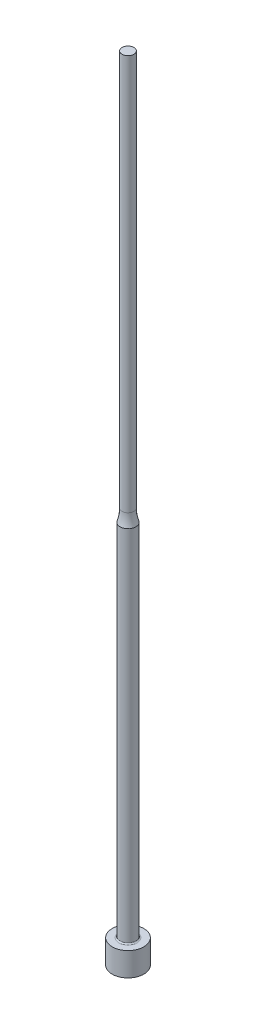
ISO-10303-21;
HEADER;
FILE_DESCRIPTION(('STEP AP214'),'2;1');
FILE_NAME('part.step','',(''),(''),'','','');
FILE_SCHEMA(('AUTOMOTIVE_DESIGN { 1 0 10303 214 1 1 1 1 }'));
ENDSEC;
DATA;
#1=APPLICATION_CONTEXT('core data for automotive mechanical design processes');
#2=APPLICATION_PROTOCOL_DEFINITION('international standard','automotive_design',2000,#1);
#3=PRODUCT_CONTEXT('',#1,'mechanical');
#4=PRODUCT('Part','Part','',(#3));
#5=PRODUCT_RELATED_PRODUCT_CATEGORY('part','',(#4));
#6=PRODUCT_DEFINITION_FORMATION('','',#4);
#7=PRODUCT_DEFINITION_CONTEXT('part definition',#1,'design');
#8=PRODUCT_DEFINITION('design','',#6,#7);
#9=PRODUCT_DEFINITION_SHAPE('','',#8);
#10=(LENGTH_UNIT() NAMED_UNIT(*) SI_UNIT(.MILLI.,.METRE.));
#11=(NAMED_UNIT(*) PLANE_ANGLE_UNIT() SI_UNIT($,.RADIAN.));
#12=(NAMED_UNIT(*) SI_UNIT($,.STERADIAN.) SOLID_ANGLE_UNIT());
#13=UNCERTAINTY_MEASURE_WITH_UNIT(LENGTH_MEASURE(1.E-05),#10,'distance_accuracy_value','');
#14=(GEOMETRIC_REPRESENTATION_CONTEXT(3) GLOBAL_UNCERTAINTY_ASSIGNED_CONTEXT((#13)) GLOBAL_UNIT_ASSIGNED_CONTEXT((#10,
#11,#12)) REPRESENTATION_CONTEXT('',''));
#15=CARTESIAN_POINT('',(0.,0.,0.));
#16=DIRECTION('',(0.,0.,1.));
#17=DIRECTION('',(1.,0.,0.));
#18=AXIS2_PLACEMENT_3D('',#15,#16,#17);
#19=CARTESIAN_POINT('',(1.50000000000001,200.,0.));
#20=DIRECTION('',(0.,-1.,0.));
#21=DIRECTION('',(1.,0.,0.));
#22=AXIS2_PLACEMENT_3D('',#19,#20,#21);
#23=PLANE('',#22);
#24=CARTESIAN_POINT('',(0.,200.,0.));
#25=DIRECTION('',(0.,1.,0.));
#26=DIRECTION('',(-1.,0.,0.));
#27=AXIS2_PLACEMENT_3D('',#24,#25,#26);
#28=CIRCLE('',#27,1.50000000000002);
#29=CARTESIAN_POINT('',(-1.50000000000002,200.,0.));
#30=VERTEX_POINT('',#29);
#31=EDGE_CURVE('E10',#30,#30,#28,.T.);
#32=ORIENTED_EDGE('',*,*,#31,.T.);
#33=EDGE_LOOP('',(#32));
#34=FACE_BOUND('',#33,.T.);
#35=ADVANCED_FACE('F30',(#34),#23,.F.);
#36=CARTESIAN_POINT('',(0.,200.,0.));
#37=DIRECTION('',(0.,1.,0.));
#38=DIRECTION('',(-1.,0.,0.));
#39=AXIS2_PLACEMENT_3D('',#36,#37,#38);
#40=CYLINDRICAL_SURFACE('',#39,1.50000000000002);
#41=ORIENTED_EDGE('',*,*,#31,.F.);
#42=EDGE_LOOP('',(#41));
#43=FACE_BOUND('',#42,.T.);
#44=CARTESIAN_POINT('',(0.,100.,0.));
#45=DIRECTION('',(0.,1.,0.));
#46=DIRECTION('',(-1.,0.,0.));
#47=AXIS2_PLACEMENT_3D('',#44,#45,#46);
#48=CIRCLE('',#47,1.50000000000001);
#49=CARTESIAN_POINT('',(-1.50000000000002,100.,0.));
#50=VERTEX_POINT('',#49);
#51=EDGE_CURVE('E36',#50,#50,#48,.T.);
#52=ORIENTED_EDGE('',*,*,#51,.T.);
#53=EDGE_LOOP('',(#52));
#54=FACE_BOUND('',#53,.T.);
#55=ADVANCED_FACE('F71',(#43,#54),#40,.T.);
#56=CARTESIAN_POINT('',(0.,100.,0.));
#57=DIRECTION('',(0.,1.,0.));
#58=DIRECTION('',(-1.,0.,0.));
#59=AXIS2_PLACEMENT_3D('',#56,#57,#58);
#60=TOROIDAL_SURFACE('',#59,11.5,10.);
#61=ORIENTED_EDGE('',*,*,#51,.F.);
#62=EDGE_LOOP('',(#61));
#63=FACE_BOUND('',#62,.T.);
#64=CARTESIAN_POINT('',(0.,96.8775010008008,0.));
#65=DIRECTION('',(0.,1.,0.));
#66=DIRECTION('',(-1.,0.,0.));
#67=AXIS2_PLACEMENT_3D('',#64,#65,#66);
#68=CIRCLE('',#67,2.00000000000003);
#69=CARTESIAN_POINT('',(-2.00000000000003,96.8775010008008,0.));
#70=VERTEX_POINT('',#69);
#71=EDGE_CURVE('E40',#70,#70,#68,.T.);
#72=ORIENTED_EDGE('',*,*,#71,.T.);
#73=EDGE_LOOP('',(#72));
#74=FACE_BOUND('',#73,.T.);
#75=ADVANCED_FACE('F75',(#63,#74),#60,.F.);
#76=CARTESIAN_POINT('',(0.,200.,0.));
#77=DIRECTION('',(0.,1.,0.));
#78=DIRECTION('',(-1.,0.,0.));
#79=AXIS2_PLACEMENT_3D('',#76,#77,#78);
#80=CYLINDRICAL_SURFACE('',#79,2.00000000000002);
#81=ORIENTED_EDGE('',*,*,#71,.F.);
#82=EDGE_LOOP('',(#81));
#83=FACE_BOUND('',#82,.T.);
#84=CARTESIAN_POINT('',(0.,6.3,0.));
#85=DIRECTION('',(0.,1.,0.));
#86=DIRECTION('',(-1.,0.,0.));
#87=AXIS2_PLACEMENT_3D('',#84,#85,#86);
#88=CIRCLE('',#87,2.00000000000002);
#89=CARTESIAN_POINT('',(-2.00000000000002,6.3,0.));
#90=VERTEX_POINT('',#89);
#91=EDGE_CURVE('E44',#90,#90,#88,.T.);
#92=ORIENTED_EDGE('',*,*,#91,.T.);
#93=EDGE_LOOP('',(#92));
#94=FACE_BOUND('',#93,.T.);
#95=ADVANCED_FACE('F80',(#83,#94),#80,.T.);
#96=CARTESIAN_POINT('',(0.,6.3,0.));
#97=DIRECTION('',(0.,1.,0.));
#98=DIRECTION('',(-1.,0.,0.));
#99=AXIS2_PLACEMENT_3D('',#96,#97,#98);
#100=TOROIDAL_SURFACE('',#99,2.30000000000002,0.3);
#101=ORIENTED_EDGE('',*,*,#91,.F.);
#102=EDGE_LOOP('',(#101));
#103=FACE_BOUND('',#102,.T.);
#104=CARTESIAN_POINT('',(0.,6.00000000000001,0.));
#105=DIRECTION('',(0.,1.,0.));
#106=DIRECTION('',(-1.,0.,0.));
#107=AXIS2_PLACEMENT_3D('',#104,#105,#106);
#108=CIRCLE('',#107,2.30000000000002);
#109=CARTESIAN_POINT('',(-2.30000000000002,6.00000000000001,0.));
#110=VERTEX_POINT('',#109);
#111=EDGE_CURVE('E49',#110,#110,#108,.T.);
#112=ORIENTED_EDGE('',*,*,#111,.T.);
#113=EDGE_LOOP('',(#112));
#114=FACE_BOUND('',#113,.T.);
#115=ADVANCED_FACE('F86',(#103,#114),#100,.F.);
#116=CARTESIAN_POINT('',(4.00000000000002,6.,0.));
#117=DIRECTION('',(0.,-1.,0.));
#118=DIRECTION('',(1.,0.,0.));
#119=AXIS2_PLACEMENT_3D('',#116,#117,#118);
#120=PLANE('',#119);
#121=ORIENTED_EDGE('',*,*,#111,.F.);
#122=EDGE_LOOP('',(#121));
#123=FACE_BOUND('',#122,.T.);
#124=CARTESIAN_POINT('',(0.,6.00000000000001,0.));
#125=DIRECTION('',(0.,1.,0.));
#126=DIRECTION('',(-1.,0.,0.));
#127=AXIS2_PLACEMENT_3D('',#124,#125,#126);
#128=CIRCLE('',#127,4.00000000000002);
#129=CARTESIAN_POINT('',(-4.00000000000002,6.00000000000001,0.));
#130=VERTEX_POINT('',#129);
#131=EDGE_CURVE('E52',#130,#130,#128,.T.);
#132=ORIENTED_EDGE('',*,*,#131,.T.);
#133=EDGE_LOOP('',(#132));
#134=FACE_BOUND('',#133,.T.);
#135=ADVANCED_FACE('F67',(#123,#134),#120,.F.);
#136=CARTESIAN_POINT('',(0.,200.,0.));
#137=DIRECTION('',(0.,1.,0.));
#138=DIRECTION('',(-1.,0.,0.));
#139=AXIS2_PLACEMENT_3D('',#136,#137,#138);
#140=CYLINDRICAL_SURFACE('',#139,4.00000000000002);
#141=ORIENTED_EDGE('',*,*,#131,.F.);
#142=EDGE_LOOP('',(#141));
#143=FACE_BOUND('',#142,.T.);
#144=CARTESIAN_POINT('',(0.,0.,0.));
#145=DIRECTION('',(0.,1.,0.));
#146=DIRECTION('',(-1.,0.,0.));
#147=AXIS2_PLACEMENT_3D('',#144,#145,#146);
#148=CIRCLE('',#147,4.00000000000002);
#149=CARTESIAN_POINT('',(-4.00000000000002,0.,0.));
#150=VERTEX_POINT('',#149);
#151=EDGE_CURVE('E55',#150,#150,#148,.T.);
#152=ORIENTED_EDGE('',*,*,#151,.T.);
#153=EDGE_LOOP('',(#152));
#154=FACE_BOUND('',#153,.T.);
#155=ADVANCED_FACE('F59',(#143,#154),#140,.T.);
#156=CARTESIAN_POINT('',(0.,0.,0.));
#157=DIRECTION('',(0.,1.,0.));
#158=DIRECTION('',(-1.,0.,0.));
#159=AXIS2_PLACEMENT_3D('',#156,#157,#158);
#160=PLANE('',#159);
#161=ORIENTED_EDGE('',*,*,#151,.F.);
#162=EDGE_LOOP('',(#161));
#163=FACE_BOUND('',#162,.T.);
#164=ADVANCED_FACE('F61',(#163),#160,.F.);
#165=CLOSED_SHELL('',(#35,#55,#75,#95,#115,#135,#155,#164));
#166=MANIFOLD_SOLID_BREP('B2',#165);
#167=ADVANCED_BREP_SHAPE_REPRESENTATION('',(#18,#166),#14);
#168=SHAPE_DEFINITION_REPRESENTATION(#9,#167);
ENDSEC;
END-ISO-10303-21;
